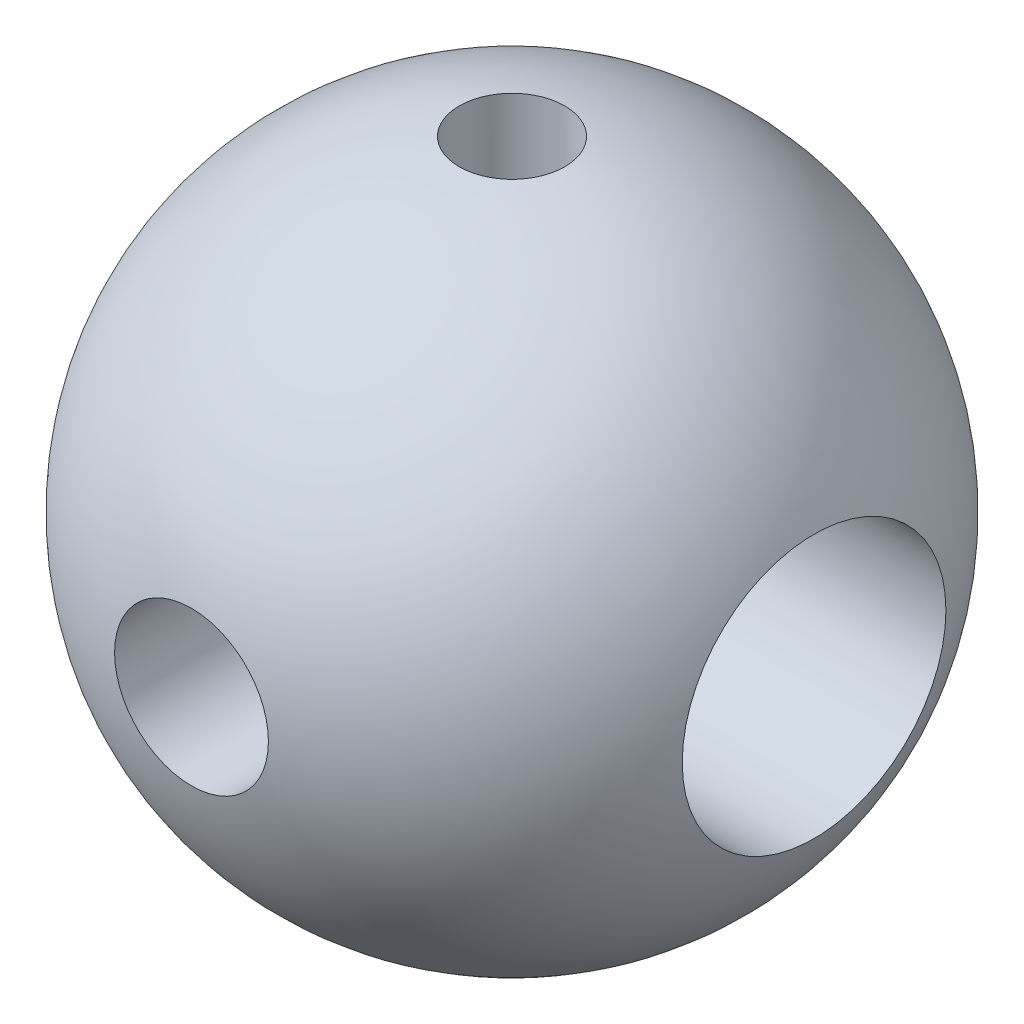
from build123d import *

# Parameters (mm, degrees)
ENL_V_MAT_EXTRU_1_DEPTH      = 130.903810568
ENL_V_MAT_EXTRU_1_DEPTH_BACK = 130.903810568
ESQUISSE2_R                  = 12
ENL_V_MAT_EXTRU_2_DEPTH      = 130.348366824
ENL_V_MAT_EXTRU_2_DEPTH_BACK = 130.348366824
ESQUISSE3_R                  = 17.5
ENL_V_MAT_EXTRU_3_DEPTH      = 129.159080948
ENL_V_MAT_EXTRU_3_DEPTH_BACK = 129.159080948
ESQUISSE4_R                  = 30


with BuildPart() as part:
    # Esquisse1 → R_volution1 (revolve)
    with BuildSketch(Plane.XY):
        with BuildLine():
            Line((0, 75), (0, -75))
            ThreePointArc((0, -75), (-75, 0), (0, 75))
        make_face()
    revolve(axis=Axis((0, 75, 0), (0, -1, 0)))

    # Esquisse2 → Enl_v. mat.-Extru.1 (cut, two sides: drawn at the far end of the back side and taken through both)
    with BuildSketch(Plane(origin=(0, 0, 0), x_dir=(1, 0, 0), z_dir=(0, 1, 0)).offset(-ENL_V_MAT_EXTRU_1_DEPTH_BACK)):
        Circle(ESQUISSE2_R)
    extrude(amount=ENL_V_MAT_EXTRU_1_DEPTH + ENL_V_MAT_EXTRU_1_DEPTH_BACK, mode=Mode.SUBTRACT)

    # Esquisse3 → Enl_v. mat.-Extru.2 (cut, two sides: drawn at the far end of the back side and taken through both)
    with BuildSketch(Plane.XY.offset(-ENL_V_MAT_EXTRU_2_DEPTH_BACK)):
        Circle(ESQUISSE3_R)
    extrude(amount=ENL_V_MAT_EXTRU_2_DEPTH + ENL_V_MAT_EXTRU_2_DEPTH_BACK, mode=Mode.SUBTRACT)

    # Esquisse4 → Enl_v. mat.-Extru.3 (cut, two sides: drawn at the far end of the back side and taken through both)
    with BuildSketch(Plane(origin=(0, 0, 0), x_dir=(0, 0, -1), z_dir=(1, 0, 0)).offset(-ENL_V_MAT_EXTRU_3_DEPTH_BACK)):
        Circle(ESQUISSE4_R)
    extrude(amount=ENL_V_MAT_EXTRU_3_DEPTH + ENL_V_MAT_EXTRU_3_DEPTH_BACK, mode=Mode.SUBTRACT)


solid = part.part
